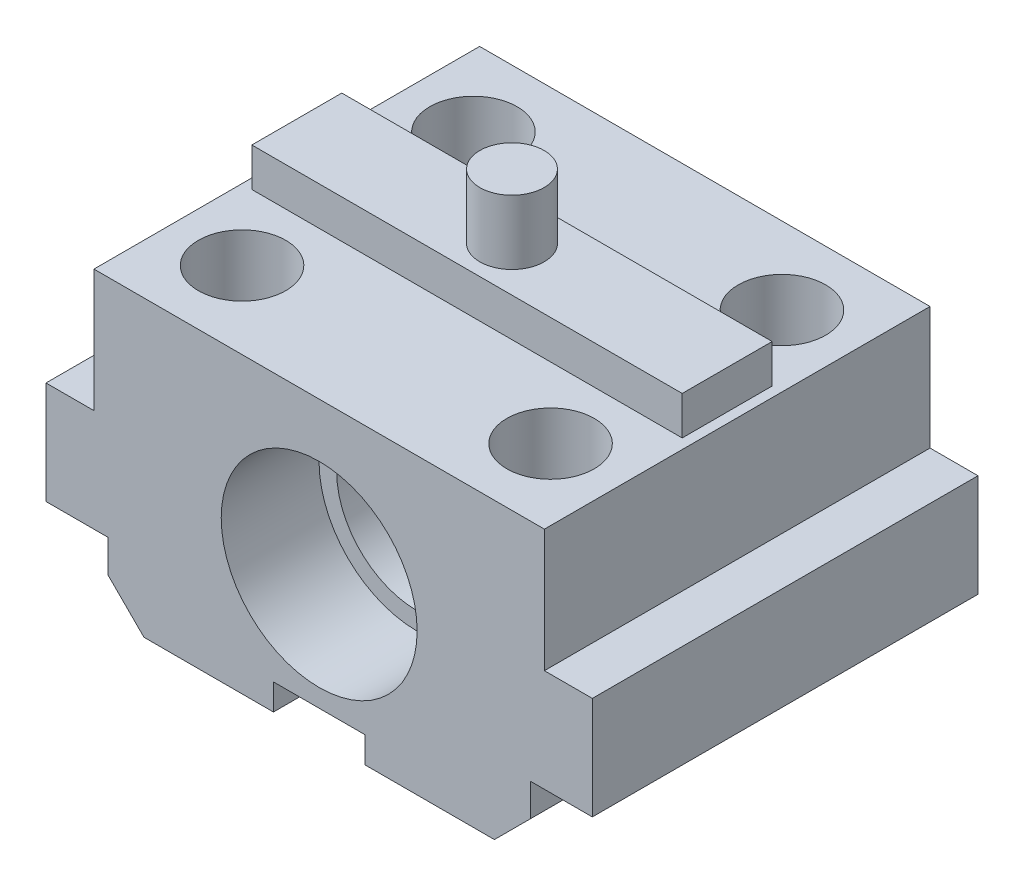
ISO-10303-21;
HEADER;
FILE_DESCRIPTION(('STEP AP214'),'2;1');
FILE_NAME('part.step','',(''),(''),'','','');
FILE_SCHEMA(('AUTOMOTIVE_DESIGN { 1 0 10303 214 1 1 1 1 }'));
ENDSEC;
DATA;
#1=APPLICATION_CONTEXT('core data for automotive mechanical design processes');
#2=APPLICATION_PROTOCOL_DEFINITION('international standard','automotive_design',2000,#1);
#3=PRODUCT_CONTEXT('',#1,'mechanical');
#4=PRODUCT('Part','Part','',(#3));
#5=PRODUCT_RELATED_PRODUCT_CATEGORY('part','',(#4));
#6=PRODUCT_DEFINITION_FORMATION('','',#4);
#7=PRODUCT_DEFINITION_CONTEXT('part definition',#1,'design');
#8=PRODUCT_DEFINITION('design','',#6,#7);
#9=PRODUCT_DEFINITION_SHAPE('','',#8);
#10=(LENGTH_UNIT() NAMED_UNIT(*) SI_UNIT(.MILLI.,.METRE.));
#11=(NAMED_UNIT(*) PLANE_ANGLE_UNIT() SI_UNIT($,.RADIAN.));
#12=(NAMED_UNIT(*) SI_UNIT($,.STERADIAN.) SOLID_ANGLE_UNIT());
#13=UNCERTAINTY_MEASURE_WITH_UNIT(LENGTH_MEASURE(1.E-05),#10,'distance_accuracy_value','');
#14=(GEOMETRIC_REPRESENTATION_CONTEXT(3) GLOBAL_UNCERTAINTY_ASSIGNED_CONTEXT((#13)) GLOBAL_UNIT_ASSIGNED_CONTEXT((#10,
#11,#12)) REPRESENTATION_CONTEXT('',''));
#15=CARTESIAN_POINT('',(0.,0.,0.));
#16=DIRECTION('',(0.,0.,1.));
#17=DIRECTION('',(1.,0.,0.));
#18=AXIS2_PLACEMENT_3D('',#15,#16,#17);
#19=CARTESIAN_POINT('',(0.,0.,15.));
#20=DIRECTION('',(0.,0.,-1.));
#21=DIRECTION('',(-1.,0.,0.));
#22=AXIS2_PLACEMENT_3D('',#19,#20,#21);
#23=CYLINDRICAL_SURFACE('',#22,6.25);
#24=CARTESIAN_POINT('',(0.,0.,-9.412));
#25=DIRECTION('',(0.,0.,-1.));
#26=DIRECTION('',(-1.,0.,0.));
#27=AXIS2_PLACEMENT_3D('',#24,#25,#26);
#28=CIRCLE('',#27,6.25);
#29=CARTESIAN_POINT('',(-6.25,0.,-9.412));
#30=VERTEX_POINT('',#29);
#31=EDGE_CURVE('E219',#30,#30,#28,.T.);
#32=ORIENTED_EDGE('',*,*,#31,.T.);
#33=EDGE_LOOP('',(#32));
#34=FACE_BOUND('',#33,.T.);
#35=CARTESIAN_POINT('',(0.,0.,7.391176));
#36=DIRECTION('',(0.,0.,1.));
#37=DIRECTION('',(1.,0.,0.));
#38=AXIS2_PLACEMENT_3D('',#35,#36,#37);
#39=CIRCLE('',#38,6.25);
#40=CARTESIAN_POINT('',(6.25,0.,7.391176));
#41=VERTEX_POINT('',#40);
#42=EDGE_CURVE('E213',#41,#41,#39,.T.);
#43=ORIENTED_EDGE('',*,*,#42,.T.);
#44=EDGE_LOOP('',(#43));
#45=FACE_BOUND('',#44,.T.);
#46=ADVANCED_FACE('F16',(#34,#45),#23,.F.);
#47=CARTESIAN_POINT('',(0.,0.,15.));
#48=DIRECTION('',(0.,0.,1.));
#49=DIRECTION('',(1.,0.,0.));
#50=AXIS2_PLACEMENT_3D('',#47,#48,#49);
#51=PLANE('',#50);
#52=DIRECTION('',(0.,1.,0.));
#53=VECTOR('',#52,1.);
#54=CARTESIAN_POINT('',(3.556,0.,15.));
#55=LINE('',#54,#53);
#56=CARTESIAN_POINT('',(3.556,-11.049,15.));
#57=VERTEX_POINT('',#56);
#58=CARTESIAN_POINT('',(3.556,-9.017,15.));
#59=VERTEX_POINT('',#58);
#60=EDGE_CURVE('E195',#57,#59,#55,.T.);
#61=ORIENTED_EDGE('',*,*,#60,.F.);
#62=DIRECTION('',(1.,0.,0.));
#63=VECTOR('',#62,1.);
#64=CARTESIAN_POINT('',(-13.631037,-11.049,15.));
#65=LINE('',#64,#63);
#66=CARTESIAN_POINT('',(13.631037,-11.049,15.));
#67=VERTEX_POINT('',#66);
#68=EDGE_CURVE('E302',#57,#67,#65,.T.);
#69=ORIENTED_EDGE('',*,*,#68,.T.);
#70=DIRECTION('',(0.707106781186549,0.707106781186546,0.));
#71=VECTOR('',#70,1.);
#72=CARTESIAN_POINT('',(13.631037,-11.049,15.));
#73=LINE('',#72,#71);
#74=CARTESIAN_POINT('',(16.425,-8.255037,15.));
#75=VERTEX_POINT('',#74);
#76=EDGE_CURVE('E306',#67,#75,#73,.T.);
#77=ORIENTED_EDGE('',*,*,#76,.T.);
#78=DIRECTION('',(0.,1.,0.));
#79=VECTOR('',#78,1.);
#80=CARTESIAN_POINT('',(16.425,-8.255037,15.));
#81=LINE('',#80,#79);
#82=CARTESIAN_POINT('',(16.425,-5.715,15.));
#83=VERTEX_POINT('',#82);
#84=EDGE_CURVE('E308',#75,#83,#81,.T.);
#85=ORIENTED_EDGE('',*,*,#84,.T.);
#86=DIRECTION('',(1.,0.,0.));
#87=VECTOR('',#86,1.);
#88=CARTESIAN_POINT('',(16.425,-5.715,15.));
#89=LINE('',#88,#87);
#90=CARTESIAN_POINT('',(21.25,-5.715,15.));
#91=VERTEX_POINT('',#90);
#92=EDGE_CURVE('E310',#83,#91,#89,.T.);
#93=ORIENTED_EDGE('',*,*,#92,.T.);
#94=DIRECTION('',(0.,1.,0.));
#95=VECTOR('',#94,1.);
#96=CARTESIAN_POINT('',(21.25,-5.715,15.));
#97=LINE('',#96,#95);
#98=CARTESIAN_POINT('',(21.25,2.2733,15.));
#99=VERTEX_POINT('',#98);
#100=EDGE_CURVE('E312',#91,#99,#97,.T.);
#101=ORIENTED_EDGE('',*,*,#100,.T.);
#102=DIRECTION('',(-1.,0.,0.));
#103=VECTOR('',#102,1.);
#104=CARTESIAN_POINT('',(21.25,2.2733,15.));
#105=LINE('',#104,#103);
#106=CARTESIAN_POINT('',(17.51965,2.2733,15.));
#107=VERTEX_POINT('',#106);
#108=EDGE_CURVE('E314',#99,#107,#105,.T.);
#109=ORIENTED_EDGE('',*,*,#108,.T.);
#110=DIRECTION('',(0.,1.,0.));
#111=VECTOR('',#110,1.);
#112=CARTESIAN_POINT('',(17.51965,2.2733,15.));
#113=LINE('',#112,#111);
#114=CARTESIAN_POINT('',(17.51965,11.811,15.));
#115=VERTEX_POINT('',#114);
#116=EDGE_CURVE('E316',#107,#115,#113,.T.);
#117=ORIENTED_EDGE('',*,*,#116,.T.);
#118=DIRECTION('',(1.,0.,0.));
#119=VECTOR('',#118,1.);
#120=CARTESIAN_POINT('',(0.,11.811,15.));
#121=LINE('',#120,#119);
#122=CARTESIAN_POINT('',(-17.51965,11.811,15.));
#123=VERTEX_POINT('',#122);
#124=EDGE_CURVE('E276',#123,#115,#121,.T.);
#125=ORIENTED_EDGE('',*,*,#124,.F.);
#126=DIRECTION('',(0.,-1.,0.));
#127=VECTOR('',#126,1.);
#128=CARTESIAN_POINT('',(-17.51965,14.811,15.));
#129=LINE('',#128,#127);
#130=CARTESIAN_POINT('',(-17.51965,2.2733,15.));
#131=VERTEX_POINT('',#130);
#132=EDGE_CURVE('E319',#123,#131,#129,.T.);
#133=ORIENTED_EDGE('',*,*,#132,.T.);
#134=DIRECTION('',(-1.,0.,0.));
#135=VECTOR('',#134,1.);
#136=CARTESIAN_POINT('',(-17.51965,2.2733,15.));
#137=LINE('',#136,#135);
#138=CARTESIAN_POINT('',(-21.25,2.2733,15.));
#139=VERTEX_POINT('',#138);
#140=EDGE_CURVE('E321',#131,#139,#137,.T.);
#141=ORIENTED_EDGE('',*,*,#140,.T.);
#142=DIRECTION('',(0.,-1.,0.));
#143=VECTOR('',#142,1.);
#144=CARTESIAN_POINT('',(-21.25,2.2733,15.));
#145=LINE('',#144,#143);
#146=CARTESIAN_POINT('',(-21.25,-5.715,15.));
#147=VERTEX_POINT('',#146);
#148=EDGE_CURVE('E323',#139,#147,#145,.T.);
#149=ORIENTED_EDGE('',*,*,#148,.T.);
#150=DIRECTION('',(1.,0.,0.));
#151=VECTOR('',#150,1.);
#152=CARTESIAN_POINT('',(-21.25,-5.715,15.));
#153=LINE('',#152,#151);
#154=CARTESIAN_POINT('',(-16.425,-5.715,15.));
#155=VERTEX_POINT('',#154);
#156=EDGE_CURVE('E325',#147,#155,#153,.T.);
#157=ORIENTED_EDGE('',*,*,#156,.T.);
#158=DIRECTION('',(0.,-1.,0.));
#159=VECTOR('',#158,1.);
#160=CARTESIAN_POINT('',(-16.425,-5.715,15.));
#161=LINE('',#160,#159);
#162=CARTESIAN_POINT('',(-16.425,-8.255037,15.));
#163=VERTEX_POINT('',#162);
#164=EDGE_CURVE('E296',#155,#163,#161,.T.);
#165=ORIENTED_EDGE('',*,*,#164,.T.);
#166=DIRECTION('',(0.707106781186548,-0.707106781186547,0.));
#167=VECTOR('',#166,1.);
#168=CARTESIAN_POINT('',(-16.425,-8.255037,15.));
#169=LINE('',#168,#167);
#170=CARTESIAN_POINT('',(-13.631037,-11.049,15.));
#171=VERTEX_POINT('',#170);
#172=EDGE_CURVE('E299',#163,#171,#169,.T.);
#173=ORIENTED_EDGE('',*,*,#172,.T.);
#174=CARTESIAN_POINT('',(-3.556,-11.049,15.));
#175=VERTEX_POINT('',#174);
#176=EDGE_CURVE('E303',#171,#175,#65,.T.);
#177=ORIENTED_EDGE('',*,*,#176,.T.);
#178=DIRECTION('',(0.,-1.,0.));
#179=VECTOR('',#178,1.);
#180=CARTESIAN_POINT('',(-3.556,0.,15.));
#181=LINE('',#180,#179);
#182=CARTESIAN_POINT('',(-3.556,-9.017,15.));
#183=VERTEX_POINT('',#182);
#184=EDGE_CURVE('E31',#183,#175,#181,.T.);
#185=ORIENTED_EDGE('',*,*,#184,.F.);
#186=DIRECTION('',(1.,0.,0.));
#187=VECTOR('',#186,1.);
#188=CARTESIAN_POINT('',(0.,-9.017,15.));
#189=LINE('',#188,#187);
#190=EDGE_CURVE('E11',#183,#59,#189,.T.);
#191=ORIENTED_EDGE('',*,*,#190,.T.);
#192=EDGE_LOOP('',(#61,#69,#77,#85,#93,#101,#109,#117,#125,#133,#141,#149,#157,#165,#173,#177,
#185,#191));
#193=FACE_BOUND('',#192,.T.);
#194=CARTESIAN_POINT('',(0.,0.,15.));
#195=DIRECTION('',(0.,0.,1.));
#196=DIRECTION('',(1.,0.,0.));
#197=AXIS2_PLACEMENT_3D('',#194,#195,#196);
#198=CIRCLE('',#197,7.62);
#199=CARTESIAN_POINT('',(7.62,0.,15.));
#200=VERTEX_POINT('',#199);
#201=EDGE_CURVE('E201',#200,#200,#198,.T.);
#202=ORIENTED_EDGE('',*,*,#201,.F.);
#203=EDGE_LOOP('',(#202));
#204=FACE_BOUND('',#203,.T.);
#205=ADVANCED_FACE('F399',(#193,#204),#51,.T.);
#206=CARTESIAN_POINT('',(0.,0.,-15.));
#207=DIRECTION('',(0.,0.,1.));
#208=DIRECTION('',(1.,0.,0.));
#209=AXIS2_PLACEMENT_3D('',#206,#207,#208);
#210=PLANE('',#209);
#211=CARTESIAN_POINT('',(0.,0.,-15.));
#212=DIRECTION('',(0.,0.,-1.));
#213=DIRECTION('',(-1.,0.,0.));
#214=AXIS2_PLACEMENT_3D('',#211,#212,#213);
#215=CIRCLE('',#214,9.652);
#216=CARTESIAN_POINT('',(-9.652,0.,-15.));
#217=VERTEX_POINT('',#216);
#218=EDGE_CURVE('E227',#217,#217,#215,.T.);
#219=ORIENTED_EDGE('',*,*,#218,.F.);
#220=EDGE_LOOP('',(#219));
#221=FACE_BOUND('',#220,.T.);
#222=DIRECTION('',(-1.,0.,0.));
#223=VECTOR('',#222,1.);
#224=CARTESIAN_POINT('',(0.,11.811,-15.));
#225=LINE('',#224,#223);
#226=CARTESIAN_POINT('',(17.51965,11.811,-15.));
#227=VERTEX_POINT('',#226);
#228=CARTESIAN_POINT('',(-17.51965,11.811,-15.));
#229=VERTEX_POINT('',#228);
#230=EDGE_CURVE('E272',#227,#229,#225,.T.);
#231=ORIENTED_EDGE('',*,*,#230,.F.);
#232=DIRECTION('',(0.,1.,0.));
#233=VECTOR('',#232,1.);
#234=CARTESIAN_POINT('',(17.51965,2.2733,-15.));
#235=LINE('',#234,#233);
#236=CARTESIAN_POINT('',(17.51965,2.2733,-15.));
#237=VERTEX_POINT('',#236);
#238=EDGE_CURVE('E344',#237,#227,#235,.T.);
#239=ORIENTED_EDGE('',*,*,#238,.F.);
#240=DIRECTION('',(-1.,0.,0.));
#241=VECTOR('',#240,1.);
#242=CARTESIAN_POINT('',(21.25,2.2733,-15.));
#243=LINE('',#242,#241);
#244=CARTESIAN_POINT('',(21.25,2.2733,-15.));
#245=VERTEX_POINT('',#244);
#246=EDGE_CURVE('E342',#245,#237,#243,.T.);
#247=ORIENTED_EDGE('',*,*,#246,.F.);
#248=DIRECTION('',(0.,1.,0.));
#249=VECTOR('',#248,1.);
#250=CARTESIAN_POINT('',(21.25,-5.715,-15.));
#251=LINE('',#250,#249);
#252=CARTESIAN_POINT('',(21.25,-5.715,-15.));
#253=VERTEX_POINT('',#252);
#254=EDGE_CURVE('E340',#253,#245,#251,.T.);
#255=ORIENTED_EDGE('',*,*,#254,.F.);
#256=DIRECTION('',(1.,0.,0.));
#257=VECTOR('',#256,1.);
#258=CARTESIAN_POINT('',(16.425,-5.715,-15.));
#259=LINE('',#258,#257);
#260=CARTESIAN_POINT('',(16.425,-5.715,-15.));
#261=VERTEX_POINT('',#260);
#262=EDGE_CURVE('E338',#261,#253,#259,.T.);
#263=ORIENTED_EDGE('',*,*,#262,.F.);
#264=DIRECTION('',(0.,1.,0.));
#265=VECTOR('',#264,1.);
#266=CARTESIAN_POINT('',(16.425,-8.255037,-15.));
#267=LINE('',#266,#265);
#268=CARTESIAN_POINT('',(16.425,-8.255037,-15.));
#269=VERTEX_POINT('',#268);
#270=EDGE_CURVE('E336',#269,#261,#267,.T.);
#271=ORIENTED_EDGE('',*,*,#270,.F.);
#272=DIRECTION('',(0.707106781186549,0.707106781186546,0.));
#273=VECTOR('',#272,1.);
#274=CARTESIAN_POINT('',(13.631037,-11.049,-15.));
#275=LINE('',#274,#273);
#276=CARTESIAN_POINT('',(13.631037,-11.049,-15.));
#277=VERTEX_POINT('',#276);
#278=EDGE_CURVE('E334',#277,#269,#275,.T.);
#279=ORIENTED_EDGE('',*,*,#278,.F.);
#280=DIRECTION('',(1.,0.,0.));
#281=VECTOR('',#280,1.);
#282=CARTESIAN_POINT('',(-13.631037,-11.049,-15.));
#283=LINE('',#282,#281);
#284=CARTESIAN_POINT('',(-13.631037,-11.049,-15.));
#285=VERTEX_POINT('',#284);
#286=EDGE_CURVE('E332',#285,#277,#283,.T.);
#287=ORIENTED_EDGE('',*,*,#286,.F.);
#288=DIRECTION('',(0.707106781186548,-0.707106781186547,0.));
#289=VECTOR('',#288,1.);
#290=CARTESIAN_POINT('',(-16.425,-8.255037,-15.));
#291=LINE('',#290,#289);
#292=CARTESIAN_POINT('',(-16.425,-8.255037,-15.));
#293=VERTEX_POINT('',#292);
#294=EDGE_CURVE('E330',#293,#285,#291,.T.);
#295=ORIENTED_EDGE('',*,*,#294,.F.);
#296=DIRECTION('',(0.,-1.,0.));
#297=VECTOR('',#296,1.);
#298=CARTESIAN_POINT('',(-16.425,-5.715,-15.));
#299=LINE('',#298,#297);
#300=CARTESIAN_POINT('',(-16.425,-5.715,-15.));
#301=VERTEX_POINT('',#300);
#302=EDGE_CURVE('E290',#301,#293,#299,.T.);
#303=ORIENTED_EDGE('',*,*,#302,.F.);
#304=DIRECTION('',(1.,0.,0.));
#305=VECTOR('',#304,1.);
#306=CARTESIAN_POINT('',(-21.25,-5.715,-15.));
#307=LINE('',#306,#305);
#308=CARTESIAN_POINT('',(-21.25,-5.715,-15.));
#309=VERTEX_POINT('',#308);
#310=EDGE_CURVE('E300',#309,#301,#307,.T.);
#311=ORIENTED_EDGE('',*,*,#310,.F.);
#312=DIRECTION('',(0.,-1.,0.));
#313=VECTOR('',#312,1.);
#314=CARTESIAN_POINT('',(-21.25,2.2733,-15.));
#315=LINE('',#314,#313);
#316=CARTESIAN_POINT('',(-21.25,2.2733,-15.));
#317=VERTEX_POINT('',#316);
#318=EDGE_CURVE('E351',#317,#309,#315,.T.);
#319=ORIENTED_EDGE('',*,*,#318,.F.);
#320=DIRECTION('',(-1.,0.,0.));
#321=VECTOR('',#320,1.);
#322=CARTESIAN_POINT('',(-17.51965,2.2733,-15.));
#323=LINE('',#322,#321);
#324=CARTESIAN_POINT('',(-17.51965,2.2733,-15.));
#325=VERTEX_POINT('',#324);
#326=EDGE_CURVE('E349',#325,#317,#323,.T.);
#327=ORIENTED_EDGE('',*,*,#326,.F.);
#328=DIRECTION('',(0.,-1.,0.));
#329=VECTOR('',#328,1.);
#330=CARTESIAN_POINT('',(-17.51965,14.811,-15.));
#331=LINE('',#330,#329);
#332=EDGE_CURVE('E347',#229,#325,#331,.T.);
#333=ORIENTED_EDGE('',*,*,#332,.F.);
#334=EDGE_LOOP('',(#231,#239,#247,#255,#263,#271,#279,#287,#295,#303,#311,#319,#327,#333));
#335=FACE_BOUND('',#334,.T.);
#336=ADVANCED_FACE('F411',(#221,#335),#210,.F.);
#337=CARTESIAN_POINT('',(17.51965,2.2733,15.));
#338=DIRECTION('',(-1.,0.,0.));
#339=DIRECTION('',(0.,-1.,0.));
#340=AXIS2_PLACEMENT_3D('',#337,#338,#339);
#341=PLANE('',#340);
#342=DIRECTION('',(0.,0.,-1.));
#343=VECTOR('',#342,1.);
#344=CARTESIAN_POINT('',(17.51965,11.811,0.));
#345=LINE('',#344,#343);
#346=EDGE_CURVE('E270',#115,#227,#345,.T.);
#347=ORIENTED_EDGE('',*,*,#346,.F.);
#348=ORIENTED_EDGE('',*,*,#116,.F.);
#349=DIRECTION('',(0.,0.,-1.));
#350=VECTOR('',#349,1.);
#351=CARTESIAN_POINT('',(17.51965,2.2733,15.));
#352=LINE('',#351,#350);
#353=EDGE_CURVE('E365',#107,#237,#352,.T.);
#354=ORIENTED_EDGE('',*,*,#353,.T.);
#355=ORIENTED_EDGE('',*,*,#238,.T.);
#356=EDGE_LOOP('',(#347,#348,#354,#355));
#357=FACE_BOUND('',#356,.T.);
#358=ADVANCED_FACE('F454',(#357),#341,.F.);
#359=CARTESIAN_POINT('',(-17.51965,14.811,15.));
#360=DIRECTION('',(1.,0.,0.));
#361=DIRECTION('',(0.,1.,0.));
#362=AXIS2_PLACEMENT_3D('',#359,#360,#361);
#363=PLANE('',#362);
#364=DIRECTION('',(0.,0.,1.));
#365=VECTOR('',#364,1.);
#366=CARTESIAN_POINT('',(-17.51965,11.811,0.));
#367=LINE('',#366,#365);
#368=EDGE_CURVE('E274',#229,#123,#367,.T.);
#369=ORIENTED_EDGE('',*,*,#368,.F.);
#370=ORIENTED_EDGE('',*,*,#332,.T.);
#371=DIRECTION('',(0.,0.,-1.));
#372=VECTOR('',#371,1.);
#373=CARTESIAN_POINT('',(-17.51965,2.2733,15.));
#374=LINE('',#373,#372);
#375=EDGE_CURVE('E362',#131,#325,#374,.T.);
#376=ORIENTED_EDGE('',*,*,#375,.F.);
#377=ORIENTED_EDGE('',*,*,#132,.F.);
#378=EDGE_LOOP('',(#369,#370,#376,#377));
#379=FACE_BOUND('',#378,.T.);
#380=ADVANCED_FACE('F469',(#379),#363,.F.);
#381=CARTESIAN_POINT('',(-16.425,-5.715,15.));
#382=DIRECTION('',(1.,0.,0.));
#383=DIRECTION('',(0.,0.,-1.));
#384=AXIS2_PLACEMENT_3D('',#381,#382,#383);
#385=PLANE('',#384);
#386=ORIENTED_EDGE('',*,*,#302,.T.);
#387=DIRECTION('',(0.,0.,-1.));
#388=VECTOR('',#387,1.);
#389=CARTESIAN_POINT('',(-16.425,-8.255037,15.));
#390=LINE('',#389,#388);
#391=EDGE_CURVE('E386',#163,#293,#390,.T.);
#392=ORIENTED_EDGE('',*,*,#391,.F.);
#393=ORIENTED_EDGE('',*,*,#164,.F.);
#394=DIRECTION('',(0.,0.,-1.));
#395=VECTOR('',#394,1.);
#396=CARTESIAN_POINT('',(-16.425,-5.715,15.));
#397=LINE('',#396,#395);
#398=EDGE_CURVE('E327',#155,#301,#397,.T.);
#399=ORIENTED_EDGE('',*,*,#398,.T.);
#400=EDGE_LOOP('',(#386,#392,#393,#399));
#401=FACE_BOUND('',#400,.T.);
#402=ADVANCED_FACE('F18',(#401),#385,.F.);
#403=CARTESIAN_POINT('',(-16.425,-8.255037,15.));
#404=DIRECTION('',(0.707106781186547,0.707106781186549,0.));
#405=DIRECTION('',(-0.707106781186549,0.707106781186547,0.));
#406=AXIS2_PLACEMENT_3D('',#403,#404,#405);
#407=PLANE('',#406);
#408=ORIENTED_EDGE('',*,*,#294,.T.);
#409=DIRECTION('',(0.,0.,-1.));
#410=VECTOR('',#409,1.);
#411=CARTESIAN_POINT('',(-13.631037,-11.049,15.));
#412=LINE('',#411,#410);
#413=EDGE_CURVE('E383',#171,#285,#412,.T.);
#414=ORIENTED_EDGE('',*,*,#413,.F.);
#415=ORIENTED_EDGE('',*,*,#172,.F.);
#416=ORIENTED_EDGE('',*,*,#391,.T.);
#417=EDGE_LOOP('',(#408,#414,#415,#416));
#418=FACE_BOUND('',#417,.T.);
#419=ADVANCED_FACE('F405',(#418),#407,.F.);
#420=CARTESIAN_POINT('',(-13.631037,-11.049,15.));
#421=DIRECTION('',(0.,1.,0.));
#422=DIRECTION('',(0.,0.,1.));
#423=AXIS2_PLACEMENT_3D('',#420,#421,#422);
#424=PLANE('',#423);
#425=CARTESIAN_POINT('',(-11.,-11.049,0.));
#426=DIRECTION('',(0.,-1.,0.));
#427=DIRECTION('',(0.,0.,-1.));
#428=AXIS2_PLACEMENT_3D('',#425,#426,#427);
#429=CIRCLE('',#428,2.45745);
#430=CARTESIAN_POINT('',(-11.,-11.049,-2.45745));
#431=VERTEX_POINT('',#430);
#432=EDGE_CURVE('E202',#431,#431,#429,.T.);
#433=ORIENTED_EDGE('',*,*,#432,.F.);
#434=EDGE_LOOP('',(#433));
#435=FACE_BOUND('',#434,.T.);
#436=CARTESIAN_POINT('',(11.,-11.049,0.));
#437=DIRECTION('',(0.,-1.,0.));
#438=DIRECTION('',(0.,0.,-1.));
#439=AXIS2_PLACEMENT_3D('',#436,#437,#438);
#440=CIRCLE('',#439,2.45745);
#441=CARTESIAN_POINT('',(11.,-11.049,-2.45745));
#442=VERTEX_POINT('',#441);
#443=EDGE_CURVE('E197',#442,#442,#440,.T.);
#444=ORIENTED_EDGE('',*,*,#443,.F.);
#445=EDGE_LOOP('',(#444));
#446=FACE_BOUND('',#445,.T.);
#447=ORIENTED_EDGE('',*,*,#68,.F.);
#448=DIRECTION('',(0.,0.,1.));
#449=VECTOR('',#448,1.);
#450=CARTESIAN_POINT('',(3.556,-11.049,27.954));
#451=LINE('',#450,#449);
#452=CARTESIAN_POINT('',(3.556,-11.049,2.046));
#453=VERTEX_POINT('',#452);
#454=EDGE_CURVE('E173',#453,#57,#451,.T.);
#455=ORIENTED_EDGE('',*,*,#454,.F.);
#456=CARTESIAN_POINT('',(0.,-11.049,2.046));
#457=DIRECTION('',(0.,-1.,0.));
#458=DIRECTION('',(0.,0.,-1.));
#459=AXIS2_PLACEMENT_3D('',#456,#457,#458);
#460=CIRCLE('',#459,3.556);
#461=CARTESIAN_POINT('',(-3.556,-11.049,2.046));
#462=VERTEX_POINT('',#461);
#463=EDGE_CURVE('E189',#462,#453,#460,.T.);
#464=ORIENTED_EDGE('',*,*,#463,.F.);
#465=DIRECTION('',(0.,0.,1.));
#466=VECTOR('',#465,1.);
#467=CARTESIAN_POINT('',(-3.556,-11.049,15.));
#468=LINE('',#467,#466);
#469=EDGE_CURVE('E24',#462,#175,#468,.T.);
#470=ORIENTED_EDGE('',*,*,#469,.T.);
#471=ORIENTED_EDGE('',*,*,#176,.F.);
#472=ORIENTED_EDGE('',*,*,#413,.T.);
#473=ORIENTED_EDGE('',*,*,#286,.T.);
#474=DIRECTION('',(0.,0.,-1.));
#475=VECTOR('',#474,1.);
#476=CARTESIAN_POINT('',(13.631037,-11.049,15.));
#477=LINE('',#476,#475);
#478=EDGE_CURVE('E380',#67,#277,#477,.T.);
#479=ORIENTED_EDGE('',*,*,#478,.F.);
#480=EDGE_LOOP('',(#447,#455,#464,#470,#471,#472,#473,#479));
#481=FACE_BOUND('',#480,.T.);
#482=ADVANCED_FACE('F395',(#435,#446,#481),#424,.F.);
#483=CARTESIAN_POINT('',(13.631037,-11.049,15.));
#484=DIRECTION('',(-0.707106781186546,0.707106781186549,0.));
#485=DIRECTION('',(-0.707106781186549,-0.707106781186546,0.));
#486=AXIS2_PLACEMENT_3D('',#483,#484,#485);
#487=PLANE('',#486);
#488=ORIENTED_EDGE('',*,*,#278,.T.);
#489=DIRECTION('',(0.,0.,-1.));
#490=VECTOR('',#489,1.);
#491=CARTESIAN_POINT('',(16.425,-8.255037,15.));
#492=LINE('',#491,#490);
#493=EDGE_CURVE('E377',#75,#269,#492,.T.);
#494=ORIENTED_EDGE('',*,*,#493,.F.);
#495=ORIENTED_EDGE('',*,*,#76,.F.);
#496=ORIENTED_EDGE('',*,*,#478,.T.);
#497=EDGE_LOOP('',(#488,#494,#495,#496));
#498=FACE_BOUND('',#497,.T.);
#499=ADVANCED_FACE('F417',(#498),#487,.F.);
#500=CARTESIAN_POINT('',(16.425,-8.255037,15.));
#501=DIRECTION('',(-1.,0.,0.));
#502=DIRECTION('',(0.,0.,1.));
#503=AXIS2_PLACEMENT_3D('',#500,#501,#502);
#504=PLANE('',#503);
#505=ORIENTED_EDGE('',*,*,#270,.T.);
#506=DIRECTION('',(0.,0.,-1.));
#507=VECTOR('',#506,1.);
#508=CARTESIAN_POINT('',(16.425,-5.715,15.));
#509=LINE('',#508,#507);
#510=EDGE_CURVE('E374',#83,#261,#509,.T.);
#511=ORIENTED_EDGE('',*,*,#510,.F.);
#512=ORIENTED_EDGE('',*,*,#84,.F.);
#513=ORIENTED_EDGE('',*,*,#493,.T.);
#514=EDGE_LOOP('',(#505,#511,#512,#513));
#515=FACE_BOUND('',#514,.T.);
#516=ADVANCED_FACE('F421',(#515),#504,.F.);
#517=CARTESIAN_POINT('',(16.425,-5.715,15.));
#518=DIRECTION('',(0.,1.,0.));
#519=DIRECTION('',(-1.,0.,0.));
#520=AXIS2_PLACEMENT_3D('',#517,#518,#519);
#521=PLANE('',#520);
#522=ORIENTED_EDGE('',*,*,#262,.T.);
#523=DIRECTION('',(0.,0.,-1.));
#524=VECTOR('',#523,1.);
#525=CARTESIAN_POINT('',(21.25,-5.715,15.));
#526=LINE('',#525,#524);
#527=EDGE_CURVE('E371',#91,#253,#526,.T.);
#528=ORIENTED_EDGE('',*,*,#527,.F.);
#529=ORIENTED_EDGE('',*,*,#92,.F.);
#530=ORIENTED_EDGE('',*,*,#510,.T.);
#531=EDGE_LOOP('',(#522,#528,#529,#530));
#532=FACE_BOUND('',#531,.T.);
#533=ADVANCED_FACE('F488',(#532),#521,.F.);
#534=CARTESIAN_POINT('',(21.25,-5.715,15.));
#535=DIRECTION('',(-1.,0.,0.));
#536=DIRECTION('',(0.,-1.,0.));
#537=AXIS2_PLACEMENT_3D('',#534,#535,#536);
#538=PLANE('',#537);
#539=ORIENTED_EDGE('',*,*,#254,.T.);
#540=DIRECTION('',(0.,0.,-1.));
#541=VECTOR('',#540,1.);
#542=CARTESIAN_POINT('',(21.25,2.2733,15.));
#543=LINE('',#542,#541);
#544=EDGE_CURVE('E368',#99,#245,#543,.T.);
#545=ORIENTED_EDGE('',*,*,#544,.F.);
#546=ORIENTED_EDGE('',*,*,#100,.F.);
#547=ORIENTED_EDGE('',*,*,#527,.T.);
#548=EDGE_LOOP('',(#539,#545,#546,#547));
#549=FACE_BOUND('',#548,.T.);
#550=ADVANCED_FACE('F484',(#549),#538,.F.);
#551=CARTESIAN_POINT('',(21.25,2.2733,15.));
#552=DIRECTION('',(0.,-1.,0.));
#553=DIRECTION('',(1.,0.,0.));
#554=AXIS2_PLACEMENT_3D('',#551,#552,#553);
#555=PLANE('',#554);
#556=ORIENTED_EDGE('',*,*,#246,.T.);
#557=ORIENTED_EDGE('',*,*,#353,.F.);
#558=ORIENTED_EDGE('',*,*,#108,.F.);
#559=ORIENTED_EDGE('',*,*,#544,.T.);
#560=EDGE_LOOP('',(#556,#557,#558,#559));
#561=FACE_BOUND('',#560,.T.);
#562=ADVANCED_FACE('F467',(#561),#555,.F.);
#563=CARTESIAN_POINT('',(-17.51965,2.2733,15.));
#564=DIRECTION('',(0.,-1.,0.));
#565=DIRECTION('',(1.,0.,0.));
#566=AXIS2_PLACEMENT_3D('',#563,#564,#565);
#567=PLANE('',#566);
#568=ORIENTED_EDGE('',*,*,#326,.T.);
#569=DIRECTION('',(0.,0.,-1.));
#570=VECTOR('',#569,1.);
#571=CARTESIAN_POINT('',(-21.25,2.2733,15.));
#572=LINE('',#571,#570);
#573=EDGE_CURVE('E359',#139,#317,#572,.T.);
#574=ORIENTED_EDGE('',*,*,#573,.F.);
#575=ORIENTED_EDGE('',*,*,#140,.F.);
#576=ORIENTED_EDGE('',*,*,#375,.T.);
#577=EDGE_LOOP('',(#568,#574,#575,#576));
#578=FACE_BOUND('',#577,.T.);
#579=ADVANCED_FACE('F463',(#578),#567,.F.);
#580=CARTESIAN_POINT('',(-21.25,2.2733,15.));
#581=DIRECTION('',(1.,0.,0.));
#582=DIRECTION('',(0.,0.,-1.));
#583=AXIS2_PLACEMENT_3D('',#580,#581,#582);
#584=PLANE('',#583);
#585=ORIENTED_EDGE('',*,*,#318,.T.);
#586=DIRECTION('',(0.,0.,-1.));
#587=VECTOR('',#586,1.);
#588=CARTESIAN_POINT('',(-21.25,-5.715,15.));
#589=LINE('',#588,#587);
#590=EDGE_CURVE('E356',#147,#309,#589,.T.);
#591=ORIENTED_EDGE('',*,*,#590,.F.);
#592=ORIENTED_EDGE('',*,*,#148,.F.);
#593=ORIENTED_EDGE('',*,*,#573,.T.);
#594=EDGE_LOOP('',(#585,#591,#592,#593));
#595=FACE_BOUND('',#594,.T.);
#596=ADVANCED_FACE('F459',(#595),#584,.F.);
#597=CARTESIAN_POINT('',(-21.25,-5.715,15.));
#598=DIRECTION('',(0.,1.,0.));
#599=DIRECTION('',(0.,0.,1.));
#600=AXIS2_PLACEMENT_3D('',#597,#598,#599);
#601=PLANE('',#600);
#602=ORIENTED_EDGE('',*,*,#310,.T.);
#603=ORIENTED_EDGE('',*,*,#398,.F.);
#604=ORIENTED_EDGE('',*,*,#156,.F.);
#605=ORIENTED_EDGE('',*,*,#590,.T.);
#606=EDGE_LOOP('',(#602,#603,#604,#605));
#607=FACE_BOUND('',#606,.T.);
#608=ADVANCED_FACE('F456',(#607),#601,.F.);
#609=CARTESIAN_POINT('',(16.7386,11.811,0.));
#610=DIRECTION('',(1.,0.,0.));
#611=DIRECTION('',(0.,1.,0.));
#612=AXIS2_PLACEMENT_3D('',#609,#610,#611);
#613=PLANE('',#612);
#614=DIRECTION('',(0.,0.,-1.));
#615=VECTOR('',#614,1.);
#616=CARTESIAN_POINT('',(16.7386,14.811,0.));
#617=LINE('',#616,#615);
#618=CARTESIAN_POINT('',(16.7386,14.811,3.49885));
#619=VERTEX_POINT('',#618);
#620=CARTESIAN_POINT('',(16.7386,14.811,-3.49885));
#621=VERTEX_POINT('',#620);
#622=EDGE_CURVE('E39',#619,#621,#617,.T.);
#623=ORIENTED_EDGE('',*,*,#622,.F.);
#624=DIRECTION('',(0.,1.,0.));
#625=VECTOR('',#624,1.);
#626=CARTESIAN_POINT('',(16.7386,11.811,3.49885));
#627=LINE('',#626,#625);
#628=CARTESIAN_POINT('',(16.7386,11.811,3.49885));
#629=VERTEX_POINT('',#628);
#630=EDGE_CURVE('E278',#629,#619,#627,.T.);
#631=ORIENTED_EDGE('',*,*,#630,.F.);
#632=DIRECTION('',(0.,0.,-1.));
#633=VECTOR('',#632,1.);
#634=CARTESIAN_POINT('',(16.7386,11.811,0.));
#635=LINE('',#634,#633);
#636=CARTESIAN_POINT('',(16.7386,11.811,-3.49885));
#637=VERTEX_POINT('',#636);
#638=EDGE_CURVE('E259',#629,#637,#635,.T.);
#639=ORIENTED_EDGE('',*,*,#638,.T.);
#640=DIRECTION('',(0.,1.,0.));
#641=VECTOR('',#640,1.);
#642=CARTESIAN_POINT('',(16.7386,11.811,-3.49885));
#643=LINE('',#642,#641);
#644=EDGE_CURVE('E288',#637,#621,#643,.T.);
#645=ORIENTED_EDGE('',*,*,#644,.T.);
#646=EDGE_LOOP('',(#623,#631,#639,#645));
#647=FACE_BOUND('',#646,.T.);
#648=ADVANCED_FACE('F449',(#647),#613,.T.);
#649=CARTESIAN_POINT('',(0.,11.811,-3.49885));
#650=DIRECTION('',(0.,0.,1.));
#651=DIRECTION('',(1.,0.,0.));
#652=AXIS2_PLACEMENT_3D('',#649,#650,#651);
#653=PLANE('',#652);
#654=DIRECTION('',(1.,0.,0.));
#655=VECTOR('',#654,1.);
#656=CARTESIAN_POINT('',(0.,14.811,-3.49885));
#657=LINE('',#656,#655);
#658=CARTESIAN_POINT('',(-16.7386,14.811,-3.49885));
#659=VERTEX_POINT('',#658);
#660=EDGE_CURVE('E262',#659,#621,#657,.T.);
#661=ORIENTED_EDGE('',*,*,#660,.T.);
#662=ORIENTED_EDGE('',*,*,#644,.F.);
#663=DIRECTION('',(1.,0.,0.));
#664=VECTOR('',#663,1.);
#665=CARTESIAN_POINT('',(0.,11.811,-3.49885));
#666=LINE('',#665,#664);
#667=CARTESIAN_POINT('',(-16.7386,11.811,-3.49885));
#668=VERTEX_POINT('',#667);
#669=EDGE_CURVE('E267',#668,#637,#666,.T.);
#670=ORIENTED_EDGE('',*,*,#669,.F.);
#671=DIRECTION('',(0.,1.,0.));
#672=VECTOR('',#671,1.);
#673=CARTESIAN_POINT('',(-16.7386,11.811,-3.49885));
#674=LINE('',#673,#672);
#675=EDGE_CURVE('E291',#668,#659,#674,.T.);
#676=ORIENTED_EDGE('',*,*,#675,.T.);
#677=EDGE_LOOP('',(#661,#662,#670,#676));
#678=FACE_BOUND('',#677,.T.);
#679=ADVANCED_FACE('F544',(#678),#653,.F.);
#680=CARTESIAN_POINT('',(-16.7386,11.811,0.));
#681=DIRECTION('',(1.,0.,0.));
#682=DIRECTION('',(0.,1.,0.));
#683=AXIS2_PLACEMENT_3D('',#680,#681,#682);
#684=PLANE('',#683);
#685=DIRECTION('',(0.,0.,-1.));
#686=VECTOR('',#685,1.);
#687=CARTESIAN_POINT('',(-16.7386,14.811,0.));
#688=LINE('',#687,#686);
#689=CARTESIAN_POINT('',(-16.7386,14.811,3.49885));
#690=VERTEX_POINT('',#689);
#691=EDGE_CURVE('E283',#690,#659,#688,.T.);
#692=ORIENTED_EDGE('',*,*,#691,.T.);
#693=ORIENTED_EDGE('',*,*,#675,.F.);
#694=DIRECTION('',(0.,0.,-1.));
#695=VECTOR('',#694,1.);
#696=CARTESIAN_POINT('',(-16.7386,11.811,0.));
#697=LINE('',#696,#695);
#698=CARTESIAN_POINT('',(-16.7386,11.811,3.49885));
#699=VERTEX_POINT('',#698);
#700=EDGE_CURVE('E264',#699,#668,#697,.T.);
#701=ORIENTED_EDGE('',*,*,#700,.F.);
#702=DIRECTION('',(0.,1.,0.));
#703=VECTOR('',#702,1.);
#704=CARTESIAN_POINT('',(-16.7386,11.811,3.49885));
#705=LINE('',#704,#703);
#706=EDGE_CURVE('E293',#699,#690,#705,.T.);
#707=ORIENTED_EDGE('',*,*,#706,.T.);
#708=EDGE_LOOP('',(#692,#693,#701,#707));
#709=FACE_BOUND('',#708,.T.);
#710=ADVANCED_FACE('F537',(#709),#684,.F.);
#711=CARTESIAN_POINT('',(0.,11.811,3.49885));
#712=DIRECTION('',(0.,0.,1.));
#713=DIRECTION('',(1.,0.,0.));
#714=AXIS2_PLACEMENT_3D('',#711,#712,#713);
#715=PLANE('',#714);
#716=DIRECTION('',(1.,0.,0.));
#717=VECTOR('',#716,1.);
#718=CARTESIAN_POINT('',(0.,14.811,3.49885));
#719=LINE('',#718,#717);
#720=EDGE_CURVE('E280',#690,#619,#719,.T.);
#721=ORIENTED_EDGE('',*,*,#720,.F.);
#722=ORIENTED_EDGE('',*,*,#706,.F.);
#723=DIRECTION('',(1.,0.,0.));
#724=VECTOR('',#723,1.);
#725=CARTESIAN_POINT('',(0.,11.811,3.49885));
#726=LINE('',#725,#724);
#727=EDGE_CURVE('E261',#699,#629,#726,.T.);
#728=ORIENTED_EDGE('',*,*,#727,.T.);
#729=ORIENTED_EDGE('',*,*,#630,.T.);
#730=EDGE_LOOP('',(#721,#722,#728,#729));
#731=FACE_BOUND('',#730,.T.);
#732=ADVANCED_FACE('F531',(#731),#715,.T.);
#733=CARTESIAN_POINT('',(0.,11.811,0.));
#734=DIRECTION('',(0.,1.,0.));
#735=DIRECTION('',(-1.,0.,0.));
#736=AXIS2_PLACEMENT_3D('',#733,#734,#735);
#737=PLANE('',#736);
#738=CARTESIAN_POINT('',(12.,11.811,-9.));
#739=DIRECTION('',(0.,1.,0.));
#740=DIRECTION('',(-1.,0.,0.));
#741=AXIS2_PLACEMENT_3D('',#738,#739,#740);
#742=CIRCLE('',#741,3.4);
#743=CARTESIAN_POINT('',(8.6,11.811,-9.));
#744=VERTEX_POINT('',#743);
#745=EDGE_CURVE('E226',#744,#744,#742,.T.);
#746=ORIENTED_EDGE('',*,*,#745,.F.);
#747=EDGE_LOOP('',(#746));
#748=FACE_BOUND('',#747,.T.);
#749=CARTESIAN_POINT('',(12.,11.811,9.));
#750=DIRECTION('',(0.,1.,0.));
#751=DIRECTION('',(-1.,0.,0.));
#752=AXIS2_PLACEMENT_3D('',#749,#750,#751);
#753=CIRCLE('',#752,3.4);
#754=CARTESIAN_POINT('',(8.6,11.811,9.));
#755=VERTEX_POINT('',#754);
#756=EDGE_CURVE('E240',#755,#755,#753,.T.);
#757=ORIENTED_EDGE('',*,*,#756,.F.);
#758=EDGE_LOOP('',(#757));
#759=FACE_BOUND('',#758,.T.);
#760=CARTESIAN_POINT('',(-12.,11.811,9.));
#761=DIRECTION('',(0.,1.,0.));
#762=DIRECTION('',(-1.,0.,0.));
#763=AXIS2_PLACEMENT_3D('',#760,#761,#762);
#764=CIRCLE('',#763,3.4);
#765=CARTESIAN_POINT('',(-15.4,11.811,9.));
#766=VERTEX_POINT('',#765);
#767=EDGE_CURVE('E234',#766,#766,#764,.T.);
#768=ORIENTED_EDGE('',*,*,#767,.F.);
#769=EDGE_LOOP('',(#768));
#770=FACE_BOUND('',#769,.T.);
#771=CARTESIAN_POINT('',(-12.,11.811,-9.));
#772=DIRECTION('',(0.,1.,0.));
#773=DIRECTION('',(-1.,0.,0.));
#774=AXIS2_PLACEMENT_3D('',#771,#772,#773);
#775=CIRCLE('',#774,3.4);
#776=CARTESIAN_POINT('',(-15.4,11.811,-9.));
#777=VERTEX_POINT('',#776);
#778=EDGE_CURVE('E233',#777,#777,#775,.T.);
#779=ORIENTED_EDGE('',*,*,#778,.F.);
#780=EDGE_LOOP('',(#779));
#781=FACE_BOUND('',#780,.T.);
#782=ORIENTED_EDGE('',*,*,#638,.F.);
#783=ORIENTED_EDGE('',*,*,#727,.F.);
#784=ORIENTED_EDGE('',*,*,#700,.T.);
#785=ORIENTED_EDGE('',*,*,#669,.T.);
#786=EDGE_LOOP('',(#782,#783,#784,#785));
#787=FACE_BOUND('',#786,.T.);
#788=ORIENTED_EDGE('',*,*,#346,.T.);
#789=ORIENTED_EDGE('',*,*,#230,.T.);
#790=ORIENTED_EDGE('',*,*,#368,.T.);
#791=ORIENTED_EDGE('',*,*,#124,.T.);
#792=EDGE_LOOP('',(#788,#789,#790,#791));
#793=FACE_BOUND('',#792,.T.);
#794=ADVANCED_FACE('F477',(#748,#759,#770,#781,#787,#793),#737,.T.);
#795=CARTESIAN_POINT('',(17.51965,14.811,15.));
#796=DIRECTION('',(0.,-1.,0.));
#797=DIRECTION('',(1.,0.,0.));
#798=AXIS2_PLACEMENT_3D('',#795,#796,#797);
#799=PLANE('',#798);
#800=CARTESIAN_POINT('',(0.,14.811,0.));
#801=DIRECTION('',(0.,1.,0.));
#802=DIRECTION('',(-1.,0.,0.));
#803=AXIS2_PLACEMENT_3D('',#800,#801,#802);
#804=CIRCLE('',#803,2.506345);
#805=CARTESIAN_POINT('',(-2.506345,14.811,0.));
#806=VERTEX_POINT('',#805);
#807=EDGE_CURVE('E251',#806,#806,#804,.T.);
#808=ORIENTED_EDGE('',*,*,#807,.F.);
#809=EDGE_LOOP('',(#808));
#810=FACE_BOUND('',#809,.T.);
#811=ORIENTED_EDGE('',*,*,#622,.T.);
#812=ORIENTED_EDGE('',*,*,#660,.F.);
#813=ORIENTED_EDGE('',*,*,#691,.F.);
#814=ORIENTED_EDGE('',*,*,#720,.T.);
#815=EDGE_LOOP('',(#811,#812,#813,#814));
#816=FACE_BOUND('',#815,.T.);
#817=ADVANCED_FACE('F473',(#810,#816),#799,.F.);
#818=CARTESIAN_POINT('',(0.,9.811,0.));
#819=DIRECTION('',(0.,1.,0.));
#820=DIRECTION('',(-1.,0.,0.));
#821=AXIS2_PLACEMENT_3D('',#818,#819,#820);
#822=CYLINDRICAL_SURFACE('',#821,2.506345);
#823=CARTESIAN_POINT('',(0.,9.811,0.));
#824=DIRECTION('',(0.,1.,0.));
#825=DIRECTION('',(-1.,0.,0.));
#826=AXIS2_PLACEMENT_3D('',#823,#824,#825);
#827=CIRCLE('',#826,2.506345);
#828=CARTESIAN_POINT('',(-2.506345,9.811,0.));
#829=VERTEX_POINT('',#828);
#830=EDGE_CURVE('E254',#829,#829,#827,.T.);
#831=ORIENTED_EDGE('',*,*,#830,.F.);
#832=EDGE_LOOP('',(#831));
#833=FACE_BOUND('',#832,.T.);
#834=ORIENTED_EDGE('',*,*,#807,.T.);
#835=EDGE_LOOP('',(#834));
#836=FACE_BOUND('',#835,.T.);
#837=ADVANCED_FACE('F476',(#833,#836),#822,.F.);
#838=CARTESIAN_POINT('',(0.,9.811,0.));
#839=DIRECTION('',(0.,1.,0.));
#840=DIRECTION('',(-1.,0.,0.));
#841=AXIS2_PLACEMENT_3D('',#838,#839,#840);
#842=PLANE('',#841);
#843=CARTESIAN_POINT('',(0.,9.811,0.));
#844=DIRECTION('',(0.,1.,0.));
#845=DIRECTION('',(-1.,0.,0.));
#846=AXIS2_PLACEMENT_3D('',#843,#844,#845);
#847=CIRCLE('',#846,2.5);
#848=CARTESIAN_POINT('',(-2.5,9.811,0.));
#849=VERTEX_POINT('',#848);
#850=EDGE_CURVE('E853',#849,#849,#847,.T.);
#851=ORIENTED_EDGE('',*,*,#850,.F.);
#852=EDGE_LOOP('',(#851));
#853=FACE_BOUND('',#852,.T.);
#854=ORIENTED_EDGE('',*,*,#830,.T.);
#855=EDGE_LOOP('',(#854));
#856=FACE_BOUND('',#855,.T.);
#857=ADVANCED_FACE('F610',(#853,#856),#842,.T.);
#858=CARTESIAN_POINT('',(-12.,-8.189,-9.));
#859=DIRECTION('',(0.,1.,0.));
#860=DIRECTION('',(-1.,0.,0.));
#861=AXIS2_PLACEMENT_3D('',#858,#859,#860);
#862=CYLINDRICAL_SURFACE('',#861,3.4);
#863=CARTESIAN_POINT('',(-12.,-8.189,-9.));
#864=DIRECTION('',(0.,1.,0.));
#865=DIRECTION('',(-1.,0.,0.));
#866=AXIS2_PLACEMENT_3D('',#863,#864,#865);
#867=CIRCLE('',#866,3.4);
#868=CARTESIAN_POINT('',(-15.4,-8.189,-9.));
#869=VERTEX_POINT('',#868);
#870=EDGE_CURVE('E248',#869,#869,#867,.T.);
#871=ORIENTED_EDGE('',*,*,#870,.F.);
#872=EDGE_LOOP('',(#871));
#873=FACE_BOUND('',#872,.T.);
#874=ORIENTED_EDGE('',*,*,#778,.T.);
#875=EDGE_LOOP('',(#874));
#876=FACE_BOUND('',#875,.T.);
#877=ADVANCED_FACE('F619',(#873,#876),#862,.F.);
#878=CARTESIAN_POINT('',(-12.,-8.189,-9.));
#879=DIRECTION('',(0.,1.,0.));
#880=DIRECTION('',(-1.,0.,0.));
#881=AXIS2_PLACEMENT_3D('',#878,#879,#880);
#882=PLANE('',#881);
#883=ORIENTED_EDGE('',*,*,#870,.T.);
#884=EDGE_LOOP('',(#883));
#885=FACE_BOUND('',#884,.T.);
#886=ADVANCED_FACE('F628',(#885),#882,.T.);
#887=CARTESIAN_POINT('',(-12.,-8.189,9.));
#888=DIRECTION('',(0.,1.,0.));
#889=DIRECTION('',(-1.,0.,0.));
#890=AXIS2_PLACEMENT_3D('',#887,#888,#889);
#891=CYLINDRICAL_SURFACE('',#890,3.4);
#892=CARTESIAN_POINT('',(-12.,-8.189,9.));
#893=DIRECTION('',(0.,1.,0.));
#894=DIRECTION('',(-1.,0.,0.));
#895=AXIS2_PLACEMENT_3D('',#892,#893,#894);
#896=CIRCLE('',#895,3.4);
#897=CARTESIAN_POINT('',(-15.4,-8.189,9.));
#898=VERTEX_POINT('',#897);
#899=EDGE_CURVE('E230',#898,#898,#896,.T.);
#900=ORIENTED_EDGE('',*,*,#899,.F.);
#901=EDGE_LOOP('',(#900));
#902=FACE_BOUND('',#901,.T.);
#903=ORIENTED_EDGE('',*,*,#767,.T.);
#904=EDGE_LOOP('',(#903));
#905=FACE_BOUND('',#904,.T.);
#906=ADVANCED_FACE('F638',(#902,#905),#891,.F.);
#907=CARTESIAN_POINT('',(-12.,-8.189,9.));
#908=DIRECTION('',(0.,1.,0.));
#909=DIRECTION('',(-1.,0.,0.));
#910=AXIS2_PLACEMENT_3D('',#907,#908,#909);
#911=PLANE('',#910);
#912=ORIENTED_EDGE('',*,*,#899,.T.);
#913=EDGE_LOOP('',(#912));
#914=FACE_BOUND('',#913,.T.);
#915=ADVANCED_FACE('F649',(#914),#911,.T.);
#916=CARTESIAN_POINT('',(12.,-8.189,9.));
#917=DIRECTION('',(0.,1.,0.));
#918=DIRECTION('',(-1.,0.,0.));
#919=AXIS2_PLACEMENT_3D('',#916,#917,#918);
#920=CYLINDRICAL_SURFACE('',#919,3.4);
#921=CARTESIAN_POINT('',(12.,-8.189,9.));
#922=DIRECTION('',(0.,1.,0.));
#923=DIRECTION('',(-1.,0.,0.));
#924=AXIS2_PLACEMENT_3D('',#921,#922,#923);
#925=CIRCLE('',#924,3.4);
#926=CARTESIAN_POINT('',(8.6,-8.189,9.));
#927=VERTEX_POINT('',#926);
#928=EDGE_CURVE('E237',#927,#927,#925,.T.);
#929=ORIENTED_EDGE('',*,*,#928,.F.);
#930=EDGE_LOOP('',(#929));
#931=FACE_BOUND('',#930,.T.);
#932=ORIENTED_EDGE('',*,*,#756,.T.);
#933=EDGE_LOOP('',(#932));
#934=FACE_BOUND('',#933,.T.);
#935=ADVANCED_FACE('F660',(#931,#934),#920,.F.);
#936=CARTESIAN_POINT('',(12.,-8.189,9.));
#937=DIRECTION('',(0.,1.,0.));
#938=DIRECTION('',(-1.,0.,0.));
#939=AXIS2_PLACEMENT_3D('',#936,#937,#938);
#940=PLANE('',#939);
#941=ORIENTED_EDGE('',*,*,#928,.T.);
#942=EDGE_LOOP('',(#941));
#943=FACE_BOUND('',#942,.T.);
#944=ADVANCED_FACE('F671',(#943),#940,.T.);
#945=CARTESIAN_POINT('',(12.,-8.189,-9.));
#946=DIRECTION('',(0.,1.,0.));
#947=DIRECTION('',(-1.,0.,0.));
#948=AXIS2_PLACEMENT_3D('',#945,#946,#947);
#949=CYLINDRICAL_SURFACE('',#948,3.4);
#950=CARTESIAN_POINT('',(12.,-8.189,-9.));
#951=DIRECTION('',(0.,1.,0.));
#952=DIRECTION('',(-1.,0.,0.));
#953=AXIS2_PLACEMENT_3D('',#950,#951,#952);
#954=CIRCLE('',#953,3.4);
#955=CARTESIAN_POINT('',(8.6,-8.189,-9.));
#956=VERTEX_POINT('',#955);
#957=EDGE_CURVE('E243',#956,#956,#954,.T.);
#958=ORIENTED_EDGE('',*,*,#957,.F.);
#959=EDGE_LOOP('',(#958));
#960=FACE_BOUND('',#959,.T.);
#961=ORIENTED_EDGE('',*,*,#745,.T.);
#962=EDGE_LOOP('',(#961));
#963=FACE_BOUND('',#962,.T.);
#964=ADVANCED_FACE('F681',(#960,#963),#949,.F.);
#965=CARTESIAN_POINT('',(12.,-8.189,-9.));
#966=DIRECTION('',(0.,1.,0.));
#967=DIRECTION('',(-1.,0.,0.));
#968=AXIS2_PLACEMENT_3D('',#965,#966,#967);
#969=PLANE('',#968);
#970=ORIENTED_EDGE('',*,*,#957,.T.);
#971=EDGE_LOOP('',(#970));
#972=FACE_BOUND('',#971,.T.);
#973=ADVANCED_FACE('F690',(#972),#969,.T.);
#974=CARTESIAN_POINT('',(0.,0.,-13.73));
#975=DIRECTION('',(0.,0.,-1.));
#976=DIRECTION('',(-1.,0.,0.));
#977=AXIS2_PLACEMENT_3D('',#974,#975,#976);
#978=CYLINDRICAL_SURFACE('',#977,9.652);
#979=CARTESIAN_POINT('',(0.,0.,-13.73));
#980=DIRECTION('',(0.,0.,-1.));
#981=DIRECTION('',(-1.,0.,0.));
#982=AXIS2_PLACEMENT_3D('',#979,#980,#981);
#983=CIRCLE('',#982,9.652);
#984=CARTESIAN_POINT('',(-9.652,0.,-13.73));
#985=VERTEX_POINT('',#984);
#986=EDGE_CURVE('E223',#985,#985,#983,.T.);
#987=ORIENTED_EDGE('',*,*,#986,.F.);
#988=EDGE_LOOP('',(#987));
#989=FACE_BOUND('',#988,.T.);
#990=ORIENTED_EDGE('',*,*,#218,.T.);
#991=EDGE_LOOP('',(#990));
#992=FACE_BOUND('',#991,.T.);
#993=ADVANCED_FACE('F699',(#989,#992),#978,.F.);
#994=CARTESIAN_POINT('',(0.,0.,-13.73));
#995=DIRECTION('',(0.,0.,-1.));
#996=DIRECTION('',(-1.,0.,0.));
#997=AXIS2_PLACEMENT_3D('',#994,#995,#996);
#998=PLANE('',#997);
#999=CARTESIAN_POINT('',(0.,0.,-13.73));
#1000=DIRECTION('',(0.,0.,-1.));
#1001=DIRECTION('',(-1.,0.,0.));
#1002=AXIS2_PLACEMENT_3D('',#999,#1000,#1001);
#1003=CIRCLE('',#1002,7.62);
#1004=CARTESIAN_POINT('',(-7.62,0.,-13.73));
#1005=VERTEX_POINT('',#1004);
#1006=EDGE_CURVE('E220',#1005,#1005,#1003,.T.);
#1007=ORIENTED_EDGE('',*,*,#1006,.F.);
#1008=EDGE_LOOP('',(#1007));
#1009=FACE_BOUND('',#1008,.T.);
#1010=ORIENTED_EDGE('',*,*,#986,.T.);
#1011=EDGE_LOOP('',(#1010));
#1012=FACE_BOUND('',#1011,.T.);
#1013=ADVANCED_FACE('F708',(#1009,#1012),#998,.T.);
#1014=CARTESIAN_POINT('',(0.,0.,-9.412));
#1015=DIRECTION('',(0.,0.,-1.));
#1016=DIRECTION('',(-1.,0.,0.));
#1017=AXIS2_PLACEMENT_3D('',#1014,#1015,#1016);
#1018=CYLINDRICAL_SURFACE('',#1017,7.62);
#1019=CARTESIAN_POINT('',(0.,0.,-9.412));
#1020=DIRECTION('',(0.,0.,-1.));
#1021=DIRECTION('',(-1.,0.,0.));
#1022=AXIS2_PLACEMENT_3D('',#1019,#1020,#1021);
#1023=CIRCLE('',#1022,7.62);
#1024=CARTESIAN_POINT('',(-7.62,0.,-9.412));
#1025=VERTEX_POINT('',#1024);
#1026=EDGE_CURVE('E216',#1025,#1025,#1023,.T.);
#1027=ORIENTED_EDGE('',*,*,#1026,.F.);
#1028=EDGE_LOOP('',(#1027));
#1029=FACE_BOUND('',#1028,.T.);
#1030=ORIENTED_EDGE('',*,*,#1006,.T.);
#1031=EDGE_LOOP('',(#1030));
#1032=FACE_BOUND('',#1031,.T.);
#1033=ADVANCED_FACE('F718',(#1029,#1032),#1018,.F.);
#1034=CARTESIAN_POINT('',(0.,0.,-9.412));
#1035=DIRECTION('',(0.,0.,-1.));
#1036=DIRECTION('',(-1.,0.,0.));
#1037=AXIS2_PLACEMENT_3D('',#1034,#1035,#1036);
#1038=PLANE('',#1037);
#1039=ORIENTED_EDGE('',*,*,#31,.F.);
#1040=EDGE_LOOP('',(#1039));
#1041=FACE_BOUND('',#1040,.T.);
#1042=ORIENTED_EDGE('',*,*,#1026,.T.);
#1043=EDGE_LOOP('',(#1042));
#1044=FACE_BOUND('',#1043,.T.);
#1045=ADVANCED_FACE('F728',(#1041,#1044),#1038,.T.);
#1046=CARTESIAN_POINT('',(0.,0.,7.391176));
#1047=DIRECTION('',(0.,0.,1.));
#1048=DIRECTION('',(1.,0.,0.));
#1049=AXIS2_PLACEMENT_3D('',#1046,#1047,#1048);
#1050=CYLINDRICAL_SURFACE('',#1049,7.62);
#1051=CARTESIAN_POINT('',(0.,0.,7.391176));
#1052=DIRECTION('',(0.,0.,1.));
#1053=DIRECTION('',(1.,0.,0.));
#1054=AXIS2_PLACEMENT_3D('',#1051,#1052,#1053);
#1055=CIRCLE('',#1054,7.62);
#1056=CARTESIAN_POINT('',(7.62,0.,7.391176));
#1057=VERTEX_POINT('',#1056);
#1058=EDGE_CURVE('E210',#1057,#1057,#1055,.T.);
#1059=ORIENTED_EDGE('',*,*,#1058,.F.);
#1060=EDGE_LOOP('',(#1059));
#1061=FACE_BOUND('',#1060,.T.);
#1062=ORIENTED_EDGE('',*,*,#201,.T.);
#1063=EDGE_LOOP('',(#1062));
#1064=FACE_BOUND('',#1063,.T.);
#1065=ADVANCED_FACE('F738',(#1061,#1064),#1050,.F.);
#1066=CARTESIAN_POINT('',(0.,0.,7.391176));
#1067=DIRECTION('',(0.,0.,1.));
#1068=DIRECTION('',(1.,0.,0.));
#1069=AXIS2_PLACEMENT_3D('',#1066,#1067,#1068);
#1070=PLANE('',#1069);
#1071=ORIENTED_EDGE('',*,*,#42,.F.);
#1072=EDGE_LOOP('',(#1071));
#1073=FACE_BOUND('',#1072,.T.);
#1074=ORIENTED_EDGE('',*,*,#1058,.T.);
#1075=EDGE_LOOP('',(#1074));
#1076=FACE_BOUND('',#1075,.T.);
#1077=ADVANCED_FACE('F748',(#1073,#1076),#1070,.T.);
#1078=CARTESIAN_POINT('',(11.,8.001,0.));
#1079=DIRECTION('',(0.,-1.,0.));
#1080=DIRECTION('',(0.,0.,-1.));
#1081=AXIS2_PLACEMENT_3D('',#1078,#1079,#1080);
#1082=CYLINDRICAL_SURFACE('',#1081,2.45745);
#1083=CARTESIAN_POINT('',(11.,8.001,0.));
#1084=DIRECTION('',(0.,-1.,0.));
#1085=DIRECTION('',(0.,0.,-1.));
#1086=AXIS2_PLACEMENT_3D('',#1083,#1084,#1085);
#1087=CIRCLE('',#1086,2.45745);
#1088=CARTESIAN_POINT('',(11.,8.001,-2.45745));
#1089=VERTEX_POINT('',#1088);
#1090=EDGE_CURVE('E205',#1089,#1089,#1087,.T.);
#1091=ORIENTED_EDGE('',*,*,#1090,.F.);
#1092=EDGE_LOOP('',(#1091));
#1093=FACE_BOUND('',#1092,.T.);
#1094=ORIENTED_EDGE('',*,*,#443,.T.);
#1095=EDGE_LOOP('',(#1094));
#1096=FACE_BOUND('',#1095,.T.);
#1097=ADVANCED_FACE('F758',(#1093,#1096),#1082,.F.);
#1098=CARTESIAN_POINT('',(11.,8.001,0.));
#1099=DIRECTION('',(0.,-1.,0.));
#1100=DIRECTION('',(0.,0.,-1.));
#1101=AXIS2_PLACEMENT_3D('',#1098,#1099,#1100);
#1102=PLANE('',#1101);
#1103=ORIENTED_EDGE('',*,*,#1090,.T.);
#1104=EDGE_LOOP('',(#1103));
#1105=FACE_BOUND('',#1104,.T.);
#1106=ADVANCED_FACE('F768',(#1105),#1102,.T.);
#1107=CARTESIAN_POINT('',(-11.,8.001,0.));
#1108=DIRECTION('',(0.,-1.,0.));
#1109=DIRECTION('',(0.,0.,-1.));
#1110=AXIS2_PLACEMENT_3D('',#1107,#1108,#1109);
#1111=CYLINDRICAL_SURFACE('',#1110,2.45745);
#1112=CARTESIAN_POINT('',(-11.,8.001,0.));
#1113=DIRECTION('',(0.,-1.,0.));
#1114=DIRECTION('',(0.,0.,-1.));
#1115=AXIS2_PLACEMENT_3D('',#1112,#1113,#1114);
#1116=CIRCLE('',#1115,2.45745);
#1117=CARTESIAN_POINT('',(-11.,8.001,-2.45745));
#1118=VERTEX_POINT('',#1117);
#1119=EDGE_CURVE('E198',#1118,#1118,#1116,.T.);
#1120=ORIENTED_EDGE('',*,*,#1119,.F.);
#1121=EDGE_LOOP('',(#1120));
#1122=FACE_BOUND('',#1121,.T.);
#1123=ORIENTED_EDGE('',*,*,#432,.T.);
#1124=EDGE_LOOP('',(#1123));
#1125=FACE_BOUND('',#1124,.T.);
#1126=ADVANCED_FACE('F436',(#1122,#1125),#1111,.F.);
#1127=CARTESIAN_POINT('',(-11.,8.001,0.));
#1128=DIRECTION('',(0.,-1.,0.));
#1129=DIRECTION('',(0.,0.,-1.));
#1130=AXIS2_PLACEMENT_3D('',#1127,#1128,#1129);
#1131=PLANE('',#1130);
#1132=ORIENTED_EDGE('',*,*,#1119,.T.);
#1133=EDGE_LOOP('',(#1132));
#1134=FACE_BOUND('',#1133,.T.);
#1135=ADVANCED_FACE('F428',(#1134),#1131,.T.);
#1136=CARTESIAN_POINT('',(3.556,-9.017,27.954));
#1137=DIRECTION('',(1.,0.,0.));
#1138=DIRECTION('',(0.,0.,-1.));
#1139=AXIS2_PLACEMENT_3D('',#1136,#1137,#1138);
#1140=PLANE('',#1139);
#1141=ORIENTED_EDGE('',*,*,#60,.T.);
#1142=DIRECTION('',(0.,0.,1.));
#1143=VECTOR('',#1142,1.);
#1144=CARTESIAN_POINT('',(3.556,-9.017,27.954));
#1145=LINE('',#1144,#1143);
#1146=CARTESIAN_POINT('',(3.556,-9.017,2.046));
#1147=VERTEX_POINT('',#1146);
#1148=EDGE_CURVE('E182',#1147,#59,#1145,.T.);
#1149=ORIENTED_EDGE('',*,*,#1148,.F.);
#1150=DIRECTION('',(0.,-1.,0.));
#1151=VECTOR('',#1150,1.);
#1152=CARTESIAN_POINT('',(3.556,-9.017,2.046));
#1153=LINE('',#1152,#1151);
#1154=EDGE_CURVE('E181',#1147,#453,#1153,.T.);
#1155=ORIENTED_EDGE('',*,*,#1154,.T.);
#1156=ORIENTED_EDGE('',*,*,#454,.T.);
#1157=EDGE_LOOP('',(#1141,#1149,#1155,#1156));
#1158=FACE_BOUND('',#1157,.T.);
#1159=ADVANCED_FACE('F426',(#1158),#1140,.F.);
#1160=CARTESIAN_POINT('',(0.,-9.017,2.046));
#1161=DIRECTION('',(0.,-1.,0.));
#1162=DIRECTION('',(0.,0.,-1.));
#1163=AXIS2_PLACEMENT_3D('',#1160,#1161,#1162);
#1164=CYLINDRICAL_SURFACE('',#1163,3.556);
#1165=ORIENTED_EDGE('',*,*,#463,.T.);
#1166=ORIENTED_EDGE('',*,*,#1154,.F.);
#1167=CARTESIAN_POINT('',(0.,-9.017,2.046));
#1168=DIRECTION('',(0.,-1.,0.));
#1169=DIRECTION('',(0.,0.,-1.));
#1170=AXIS2_PLACEMENT_3D('',#1167,#1168,#1169);
#1171=CIRCLE('',#1170,3.556);
#1172=CARTESIAN_POINT('',(-3.556,-9.017,2.046));
#1173=VERTEX_POINT('',#1172);
#1174=EDGE_CURVE('E171',#1173,#1147,#1171,.T.);
#1175=ORIENTED_EDGE('',*,*,#1174,.F.);
#1176=DIRECTION('',(0.,-1.,0.));
#1177=VECTOR('',#1176,1.);
#1178=CARTESIAN_POINT('',(-3.556,-9.017,2.046));
#1179=LINE('',#1178,#1177);
#1180=EDGE_CURVE('E176',#1173,#462,#1179,.T.);
#1181=ORIENTED_EDGE('',*,*,#1180,.T.);
#1182=EDGE_LOOP('',(#1165,#1166,#1175,#1181));
#1183=FACE_BOUND('',#1182,.T.);
#1184=ADVANCED_FACE('F184',(#1183),#1164,.F.);
#1185=CARTESIAN_POINT('',(-3.556,-9.017,27.954));
#1186=DIRECTION('',(-1.,0.,0.));
#1187=DIRECTION('',(0.,0.,1.));
#1188=AXIS2_PLACEMENT_3D('',#1185,#1186,#1187);
#1189=PLANE('',#1188);
#1190=ORIENTED_EDGE('',*,*,#184,.T.);
#1191=ORIENTED_EDGE('',*,*,#469,.F.);
#1192=ORIENTED_EDGE('',*,*,#1180,.F.);
#1193=DIRECTION('',(0.,0.,-1.));
#1194=VECTOR('',#1193,1.);
#1195=CARTESIAN_POINT('',(-3.556,-9.017,27.954));
#1196=LINE('',#1195,#1194);
#1197=EDGE_CURVE('E166',#183,#1173,#1196,.T.);
#1198=ORIENTED_EDGE('',*,*,#1197,.F.);
#1199=EDGE_LOOP('',(#1190,#1191,#1192,#1198));
#1200=FACE_BOUND('',#1199,.T.);
#1201=ADVANCED_FACE('F177',(#1200),#1189,.F.);
#1202=CARTESIAN_POINT('',(0.,-9.017,27.954));
#1203=DIRECTION('',(0.,-1.,0.));
#1204=DIRECTION('',(0.,0.,-1.));
#1205=AXIS2_PLACEMENT_3D('',#1202,#1203,#1204);
#1206=PLANE('',#1205);
#1207=ORIENTED_EDGE('',*,*,#1197,.T.);
#1208=ORIENTED_EDGE('',*,*,#1174,.T.);
#1209=ORIENTED_EDGE('',*,*,#1148,.T.);
#1210=ORIENTED_EDGE('',*,*,#190,.F.);
#1211=EDGE_LOOP('',(#1207,#1208,#1209,#1210));
#1212=FACE_BOUND('',#1211,.T.);
#1213=ADVANCED_FACE('F168',(#1212),#1206,.T.);
#1214=CARTESIAN_POINT('',(0.,19.811,0.));
#1215=DIRECTION('',(0.,-1.,0.));
#1216=DIRECTION('',(1.,0.,0.));
#1217=AXIS2_PLACEMENT_3D('',#1214,#1215,#1216);
#1218=CYLINDRICAL_SURFACE('',#1217,2.5);
#1219=CARTESIAN_POINT('',(0.,19.811,0.));
#1220=DIRECTION('',(0.,1.,0.));
#1221=DIRECTION('',(-1.,0.,0.));
#1222=AXIS2_PLACEMENT_3D('',#1219,#1220,#1221);
#1223=CIRCLE('',#1222,2.5);
#1224=CARTESIAN_POINT('',(-2.50000000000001,19.811,0.));
#1225=VERTEX_POINT('',#1224);
#1226=EDGE_CURVE('E191',#1225,#1225,#1223,.T.);
#1227=ORIENTED_EDGE('',*,*,#1226,.F.);
#1228=EDGE_LOOP('',(#1227));
#1229=FACE_BOUND('',#1228,.T.);
#1230=ORIENTED_EDGE('',*,*,#850,.T.);
#1231=EDGE_LOOP('',(#1230));
#1232=FACE_BOUND('',#1231,.T.);
#1233=ADVANCED_FACE('F820',(#1229,#1232),#1218,.T.);
#1234=CARTESIAN_POINT('',(0.,19.811,0.));
#1235=DIRECTION('',(0.,1.,0.));
#1236=DIRECTION('',(-1.,0.,0.));
#1237=AXIS2_PLACEMENT_3D('',#1234,#1235,#1236);
#1238=PLANE('',#1237);
#1239=ORIENTED_EDGE('',*,*,#1226,.T.);
#1240=EDGE_LOOP('',(#1239));
#1241=FACE_BOUND('',#1240,.T.);
#1242=ADVANCED_FACE('F829',(#1241),#1238,.T.);
#1243=CLOSED_SHELL('',(#46,#205,#336,#358,#380,#402,#419,#482,#499,#516,#533,#550,#562,#579,
#596,#608,#648,#679,#710,#732,#794,#817,#837,#857,#877,#886,#906,#915,#935,#944,#964,#973,#993,
#1013,#1033,#1045,#1065,#1077,#1097,#1106,#1126,#1135,#1159,#1184,#1201,#1213,#1233,#1242));
#1244=MANIFOLD_SOLID_BREP('B1',#1243);
#1245=ADVANCED_BREP_SHAPE_REPRESENTATION('',(#18,#1244),#14);
#1246=SHAPE_DEFINITION_REPRESENTATION(#9,#1245);
ENDSEC;
END-ISO-10303-21;
